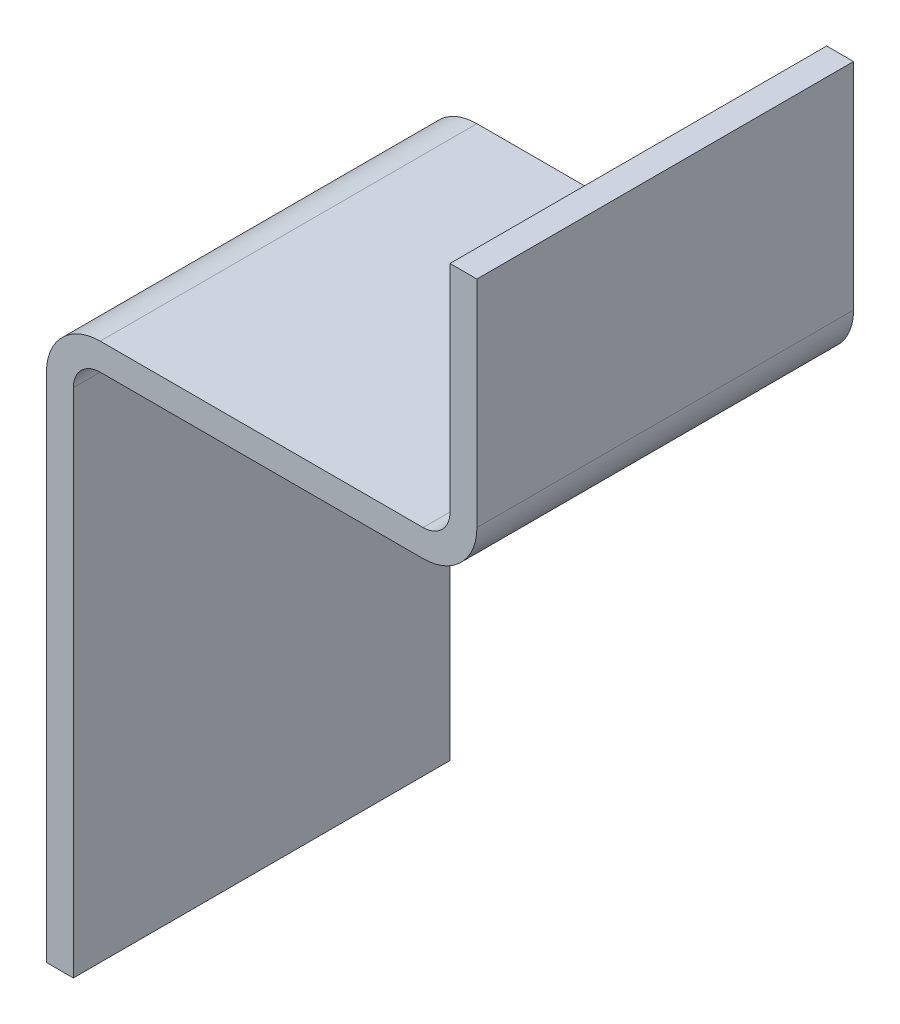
ISO-10303-21;
HEADER;
FILE_DESCRIPTION(('STEP AP214'),'2;1');
FILE_NAME('part.step','',(''),(''),'','','');
FILE_SCHEMA(('AUTOMOTIVE_DESIGN { 1 0 10303 214 1 1 1 1 }'));
ENDSEC;
DATA;
#1=APPLICATION_CONTEXT('core data for automotive mechanical design processes');
#2=APPLICATION_PROTOCOL_DEFINITION('international standard','automotive_design',2000,#1);
#3=PRODUCT_CONTEXT('',#1,'mechanical');
#4=PRODUCT('Part','Part','',(#3));
#5=PRODUCT_RELATED_PRODUCT_CATEGORY('part','',(#4));
#6=PRODUCT_DEFINITION_FORMATION('','',#4);
#7=PRODUCT_DEFINITION_CONTEXT('part definition',#1,'design');
#8=PRODUCT_DEFINITION('design','',#6,#7);
#9=PRODUCT_DEFINITION_SHAPE('','',#8);
#10=(LENGTH_UNIT() NAMED_UNIT(*) SI_UNIT(.MILLI.,.METRE.));
#11=(NAMED_UNIT(*) PLANE_ANGLE_UNIT() SI_UNIT($,.RADIAN.));
#12=(NAMED_UNIT(*) SI_UNIT($,.STERADIAN.) SOLID_ANGLE_UNIT());
#13=UNCERTAINTY_MEASURE_WITH_UNIT(LENGTH_MEASURE(1.E-05),#10,'distance_accuracy_value','');
#14=(GEOMETRIC_REPRESENTATION_CONTEXT(3) GLOBAL_UNCERTAINTY_ASSIGNED_CONTEXT((#13)) GLOBAL_UNIT_ASSIGNED_CONTEXT((#10,
#11,#12)) REPRESENTATION_CONTEXT('',''));
#15=CARTESIAN_POINT('',(0.,0.,0.));
#16=DIRECTION('',(0.,0.,1.));
#17=DIRECTION('',(1.,0.,0.));
#18=AXIS2_PLACEMENT_3D('',#15,#16,#17);
#19=CARTESIAN_POINT('',(-5.,0.,70.));
#20=DIRECTION('',(0.,1.,0.));
#21=DIRECTION('',(0.,0.,1.));
#22=AXIS2_PLACEMENT_3D('',#19,#20,#21);
#23=PLANE('',#22);
#24=DIRECTION('',(1.,0.,0.));
#25=VECTOR('',#24,1.);
#26=CARTESIAN_POINT('',(-5.,0.,0.));
#27=LINE('',#26,#25);
#28=CARTESIAN_POINT('',(-5.,0.,0.));
#29=VERTEX_POINT('',#28);
#30=CARTESIAN_POINT('',(0.,0.,0.));
#31=VERTEX_POINT('',#30);
#32=EDGE_CURVE('E124',#29,#31,#27,.T.);
#33=ORIENTED_EDGE('',*,*,#32,.T.);
#34=DIRECTION('',(0.,0.,-1.));
#35=VECTOR('',#34,1.);
#36=CARTESIAN_POINT('',(0.,0.,70.));
#37=LINE('',#36,#35);
#38=CARTESIAN_POINT('',(0.,0.,70.));
#39=VERTEX_POINT('',#38);
#40=EDGE_CURVE('E11',#39,#31,#37,.T.);
#41=ORIENTED_EDGE('',*,*,#40,.F.);
#42=DIRECTION('',(1.,0.,0.));
#43=VECTOR('',#42,1.);
#44=CARTESIAN_POINT('',(-5.,0.,70.));
#45=LINE('',#44,#43);
#46=CARTESIAN_POINT('',(-5.,0.,70.));
#47=VERTEX_POINT('',#46);
#48=EDGE_CURVE('E165',#47,#39,#45,.T.);
#49=ORIENTED_EDGE('',*,*,#48,.F.);
#50=DIRECTION('',(0.,0.,-1.));
#51=VECTOR('',#50,1.);
#52=CARTESIAN_POINT('',(-5.,0.,70.));
#53=LINE('',#52,#51);
#54=EDGE_CURVE('E43',#47,#29,#53,.T.);
#55=ORIENTED_EDGE('',*,*,#54,.T.);
#56=EDGE_LOOP('',(#33,#41,#49,#55));
#57=FACE_BOUND('',#56,.T.);
#58=ADVANCED_FACE('F29',(#57),#23,.F.);
#59=CARTESIAN_POINT('',(0.,0.,70.));
#60=DIRECTION('',(-1.,0.,0.));
#61=DIRECTION('',(0.,0.,1.));
#62=AXIS2_PLACEMENT_3D('',#59,#60,#61);
#63=PLANE('',#62);
#64=DIRECTION('',(0.,1.,0.));
#65=VECTOR('',#64,1.);
#66=CARTESIAN_POINT('',(0.,0.,0.));
#67=LINE('',#66,#65);
#68=CARTESIAN_POINT('',(0.,95.,0.));
#69=VERTEX_POINT('',#68);
#70=EDGE_CURVE('E120',#31,#69,#67,.T.);
#71=ORIENTED_EDGE('',*,*,#70,.T.);
#72=DIRECTION('',(0.,0.,-1.));
#73=VECTOR('',#72,1.);
#74=CARTESIAN_POINT('',(0.,95.,70.));
#75=LINE('',#74,#73);
#76=CARTESIAN_POINT('',(0.,95.,70.));
#77=VERTEX_POINT('',#76);
#78=EDGE_CURVE('E36',#77,#69,#75,.T.);
#79=ORIENTED_EDGE('',*,*,#78,.F.);
#80=DIRECTION('',(0.,1.,0.));
#81=VECTOR('',#80,1.);
#82=CARTESIAN_POINT('',(0.,0.,70.));
#83=LINE('',#82,#81);
#84=EDGE_CURVE('E133',#39,#77,#83,.T.);
#85=ORIENTED_EDGE('',*,*,#84,.F.);
#86=ORIENTED_EDGE('',*,*,#40,.T.);
#87=EDGE_LOOP('',(#71,#79,#85,#86));
#88=FACE_BOUND('',#87,.T.);
#89=ADVANCED_FACE('F132',(#88),#63,.F.);
#90=CARTESIAN_POINT('',(5.,95.,70.));
#91=DIRECTION('',(0.,0.,-1.));
#92=DIRECTION('',(-1.,0.,0.));
#93=AXIS2_PLACEMENT_3D('',#90,#91,#92);
#94=CYLINDRICAL_SURFACE('',#93,5.);
#95=CARTESIAN_POINT('',(5.,95.,0.));
#96=DIRECTION('',(0.,0.,-1.));
#97=DIRECTION('',(-1.,0.,0.));
#98=AXIS2_PLACEMENT_3D('',#95,#96,#97);
#99=CIRCLE('',#98,5.);
#100=CARTESIAN_POINT('',(5.,100.,0.));
#101=VERTEX_POINT('',#100);
#102=EDGE_CURVE('E126',#69,#101,#99,.T.);
#103=ORIENTED_EDGE('',*,*,#102,.T.);
#104=DIRECTION('',(0.,0.,-1.));
#105=VECTOR('',#104,1.);
#106=CARTESIAN_POINT('',(5.,100.,70.));
#107=LINE('',#106,#105);
#108=CARTESIAN_POINT('',(5.,100.,70.));
#109=VERTEX_POINT('',#108);
#110=EDGE_CURVE('E208',#109,#101,#107,.T.);
#111=ORIENTED_EDGE('',*,*,#110,.F.);
#112=CARTESIAN_POINT('',(5.,95.,70.));
#113=DIRECTION('',(0.,0.,-1.));
#114=DIRECTION('',(-1.,0.,0.));
#115=AXIS2_PLACEMENT_3D('',#112,#113,#114);
#116=CIRCLE('',#115,5.);
#117=EDGE_CURVE('E168',#77,#109,#116,.T.);
#118=ORIENTED_EDGE('',*,*,#117,.F.);
#119=ORIENTED_EDGE('',*,*,#78,.T.);
#120=EDGE_LOOP('',(#103,#111,#118,#119));
#121=FACE_BOUND('',#120,.T.);
#122=ADVANCED_FACE('F212',(#121),#94,.F.);
#123=CARTESIAN_POINT('',(5.,100.,70.));
#124=DIRECTION('',(0.,1.,0.));
#125=DIRECTION('',(0.,0.,1.));
#126=AXIS2_PLACEMENT_3D('',#123,#124,#125);
#127=PLANE('',#126);
#128=DIRECTION('',(1.,0.,0.));
#129=VECTOR('',#128,1.);
#130=CARTESIAN_POINT('',(5.,100.,0.));
#131=LINE('',#130,#129);
#132=CARTESIAN_POINT('',(65.,100.,0.));
#133=VERTEX_POINT('',#132);
#134=EDGE_CURVE('E139',#101,#133,#131,.T.);
#135=ORIENTED_EDGE('',*,*,#134,.T.);
#136=DIRECTION('',(0.,0.,-1.));
#137=VECTOR('',#136,1.);
#138=CARTESIAN_POINT('',(65.,100.,70.));
#139=LINE('',#138,#137);
#140=CARTESIAN_POINT('',(65.,100.,70.));
#141=VERTEX_POINT('',#140);
#142=EDGE_CURVE('E206',#141,#133,#139,.T.);
#143=ORIENTED_EDGE('',*,*,#142,.F.);
#144=DIRECTION('',(1.,0.,0.));
#145=VECTOR('',#144,1.);
#146=CARTESIAN_POINT('',(5.,100.,70.));
#147=LINE('',#146,#145);
#148=EDGE_CURVE('E170',#109,#141,#147,.T.);
#149=ORIENTED_EDGE('',*,*,#148,.F.);
#150=ORIENTED_EDGE('',*,*,#110,.T.);
#151=EDGE_LOOP('',(#135,#143,#149,#150));
#152=FACE_BOUND('',#151,.T.);
#153=ADVANCED_FACE('F246',(#152),#127,.F.);
#154=CARTESIAN_POINT('',(65.,110.,70.));
#155=DIRECTION('',(0.,0.,-1.));
#156=DIRECTION('',(-1.,0.,0.));
#157=AXIS2_PLACEMENT_3D('',#154,#155,#156);
#158=CYLINDRICAL_SURFACE('',#157,9.99999999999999);
#159=CARTESIAN_POINT('',(65.,110.,0.));
#160=DIRECTION('',(0.,0.,-1.));
#161=DIRECTION('',(-1.,0.,0.));
#162=AXIS2_PLACEMENT_3D('',#159,#160,#161);
#163=CIRCLE('',#162,9.99999999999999);
#164=CARTESIAN_POINT('',(75.,110.,0.));
#165=VERTEX_POINT('',#164);
#166=EDGE_CURVE('E142',#165,#133,#163,.T.);
#167=ORIENTED_EDGE('',*,*,#166,.F.);
#168=DIRECTION('',(0.,0.,-1.));
#169=VECTOR('',#168,1.);
#170=CARTESIAN_POINT('',(75.,110.,70.));
#171=LINE('',#170,#169);
#172=CARTESIAN_POINT('',(75.,110.,70.));
#173=VERTEX_POINT('',#172);
#174=EDGE_CURVE('E204',#173,#165,#171,.T.);
#175=ORIENTED_EDGE('',*,*,#174,.F.);
#176=CARTESIAN_POINT('',(65.,110.,70.));
#177=DIRECTION('',(0.,0.,-1.));
#178=DIRECTION('',(-1.,0.,0.));
#179=AXIS2_PLACEMENT_3D('',#176,#177,#178);
#180=CIRCLE('',#179,9.99999999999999);
#181=EDGE_CURVE('E172',#173,#141,#180,.T.);
#182=ORIENTED_EDGE('',*,*,#181,.T.);
#183=ORIENTED_EDGE('',*,*,#142,.T.);
#184=EDGE_LOOP('',(#167,#175,#182,#183));
#185=FACE_BOUND('',#184,.T.);
#186=ADVANCED_FACE('F243',(#185),#158,.T.);
#187=CARTESIAN_POINT('',(75.,110.,70.));
#188=DIRECTION('',(-1.,0.,0.));
#189=DIRECTION('',(0.,0.,1.));
#190=AXIS2_PLACEMENT_3D('',#187,#188,#189);
#191=PLANE('',#190);
#192=DIRECTION('',(0.,1.,0.));
#193=VECTOR('',#192,1.);
#194=CARTESIAN_POINT('',(75.,110.,0.));
#195=LINE('',#194,#193);
#196=CARTESIAN_POINT('',(75.,150.,0.));
#197=VERTEX_POINT('',#196);
#198=EDGE_CURVE('E145',#165,#197,#195,.T.);
#199=ORIENTED_EDGE('',*,*,#198,.T.);
#200=DIRECTION('',(0.,0.,-1.));
#201=VECTOR('',#200,1.);
#202=CARTESIAN_POINT('',(75.,150.,70.));
#203=LINE('',#202,#201);
#204=CARTESIAN_POINT('',(75.,150.,70.));
#205=VERTEX_POINT('',#204);
#206=EDGE_CURVE('E202',#205,#197,#203,.T.);
#207=ORIENTED_EDGE('',*,*,#206,.F.);
#208=DIRECTION('',(0.,1.,0.));
#209=VECTOR('',#208,1.);
#210=CARTESIAN_POINT('',(75.,110.,70.));
#211=LINE('',#210,#209);
#212=EDGE_CURVE('E175',#173,#205,#211,.T.);
#213=ORIENTED_EDGE('',*,*,#212,.F.);
#214=ORIENTED_EDGE('',*,*,#174,.T.);
#215=EDGE_LOOP('',(#199,#207,#213,#214));
#216=FACE_BOUND('',#215,.T.);
#217=ADVANCED_FACE('F253',(#216),#191,.F.);
#218=CARTESIAN_POINT('',(70.,150.,70.));
#219=DIRECTION('',(0.,1.,0.));
#220=DIRECTION('',(0.,0.,1.));
#221=AXIS2_PLACEMENT_3D('',#218,#219,#220);
#222=PLANE('',#221);
#223=DIRECTION('',(1.,0.,0.));
#224=VECTOR('',#223,1.);
#225=CARTESIAN_POINT('',(70.,150.,0.));
#226=LINE('',#225,#224);
#227=CARTESIAN_POINT('',(70.,150.,0.));
#228=VERTEX_POINT('',#227);
#229=EDGE_CURVE('E148',#228,#197,#226,.T.);
#230=ORIENTED_EDGE('',*,*,#229,.F.);
#231=DIRECTION('',(0.,0.,-1.));
#232=VECTOR('',#231,1.);
#233=CARTESIAN_POINT('',(70.,150.,70.));
#234=LINE('',#233,#232);
#235=CARTESIAN_POINT('',(70.,150.,70.));
#236=VERTEX_POINT('',#235);
#237=EDGE_CURVE('E200',#236,#228,#234,.T.);
#238=ORIENTED_EDGE('',*,*,#237,.F.);
#239=DIRECTION('',(1.,0.,0.));
#240=VECTOR('',#239,1.);
#241=CARTESIAN_POINT('',(70.,150.,70.));
#242=LINE('',#241,#240);
#243=EDGE_CURVE('E177',#236,#205,#242,.T.);
#244=ORIENTED_EDGE('',*,*,#243,.T.);
#245=ORIENTED_EDGE('',*,*,#206,.T.);
#246=EDGE_LOOP('',(#230,#238,#244,#245));
#247=FACE_BOUND('',#246,.T.);
#248=ADVANCED_FACE('F237',(#247),#222,.T.);
#249=CARTESIAN_POINT('',(70.,110.,70.));
#250=DIRECTION('',(-1.,0.,0.));
#251=DIRECTION('',(0.,0.,1.));
#252=AXIS2_PLACEMENT_3D('',#249,#250,#251);
#253=PLANE('',#252);
#254=DIRECTION('',(0.,1.,0.));
#255=VECTOR('',#254,1.);
#256=CARTESIAN_POINT('',(70.,110.,0.));
#257=LINE('',#256,#255);
#258=CARTESIAN_POINT('',(70.,110.,0.));
#259=VERTEX_POINT('',#258);
#260=EDGE_CURVE('E151',#259,#228,#257,.T.);
#261=ORIENTED_EDGE('',*,*,#260,.F.);
#262=DIRECTION('',(0.,0.,-1.));
#263=VECTOR('',#262,1.);
#264=CARTESIAN_POINT('',(70.,110.,70.));
#265=LINE('',#264,#263);
#266=CARTESIAN_POINT('',(70.,110.,70.));
#267=VERTEX_POINT('',#266);
#268=EDGE_CURVE('E198',#267,#259,#265,.T.);
#269=ORIENTED_EDGE('',*,*,#268,.F.);
#270=DIRECTION('',(0.,1.,0.));
#271=VECTOR('',#270,1.);
#272=CARTESIAN_POINT('',(70.,110.,70.));
#273=LINE('',#272,#271);
#274=EDGE_CURVE('E180',#267,#236,#273,.T.);
#275=ORIENTED_EDGE('',*,*,#274,.T.);
#276=ORIENTED_EDGE('',*,*,#237,.T.);
#277=EDGE_LOOP('',(#261,#269,#275,#276));
#278=FACE_BOUND('',#277,.T.);
#279=ADVANCED_FACE('F232',(#278),#253,.T.);
#280=CARTESIAN_POINT('',(65.,110.,70.));
#281=DIRECTION('',(0.,0.,-1.));
#282=DIRECTION('',(-1.,0.,0.));
#283=AXIS2_PLACEMENT_3D('',#280,#281,#282);
#284=CYLINDRICAL_SURFACE('',#283,5.);
#285=CARTESIAN_POINT('',(65.,110.,0.));
#286=DIRECTION('',(0.,0.,-1.));
#287=DIRECTION('',(-1.,0.,0.));
#288=AXIS2_PLACEMENT_3D('',#285,#286,#287);
#289=CIRCLE('',#288,5.);
#290=CARTESIAN_POINT('',(65.,105.,0.));
#291=VERTEX_POINT('',#290);
#292=EDGE_CURVE('E154',#259,#291,#289,.T.);
#293=ORIENTED_EDGE('',*,*,#292,.T.);
#294=DIRECTION('',(0.,0.,-1.));
#295=VECTOR('',#294,1.);
#296=CARTESIAN_POINT('',(65.,105.,70.));
#297=LINE('',#296,#295);
#298=CARTESIAN_POINT('',(65.,105.,70.));
#299=VERTEX_POINT('',#298);
#300=EDGE_CURVE('E196',#299,#291,#297,.T.);
#301=ORIENTED_EDGE('',*,*,#300,.F.);
#302=CARTESIAN_POINT('',(65.,110.,70.));
#303=DIRECTION('',(0.,0.,-1.));
#304=DIRECTION('',(-1.,0.,0.));
#305=AXIS2_PLACEMENT_3D('',#302,#303,#304);
#306=CIRCLE('',#305,5.);
#307=EDGE_CURVE('E183',#267,#299,#306,.T.);
#308=ORIENTED_EDGE('',*,*,#307,.F.);
#309=ORIENTED_EDGE('',*,*,#268,.T.);
#310=EDGE_LOOP('',(#293,#301,#308,#309));
#311=FACE_BOUND('',#310,.T.);
#312=ADVANCED_FACE('F229',(#311),#284,.F.);
#313=CARTESIAN_POINT('',(5.,105.,70.));
#314=DIRECTION('',(0.,1.,0.));
#315=DIRECTION('',(0.,0.,1.));
#316=AXIS2_PLACEMENT_3D('',#313,#314,#315);
#317=PLANE('',#316);
#318=DIRECTION('',(1.,0.,0.));
#319=VECTOR('',#318,1.);
#320=CARTESIAN_POINT('',(5.,105.,0.));
#321=LINE('',#320,#319);
#322=CARTESIAN_POINT('',(5.,105.,0.));
#323=VERTEX_POINT('',#322);
#324=EDGE_CURVE('E157',#323,#291,#321,.T.);
#325=ORIENTED_EDGE('',*,*,#324,.F.);
#326=DIRECTION('',(0.,0.,-1.));
#327=VECTOR('',#326,1.);
#328=CARTESIAN_POINT('',(5.,105.,70.));
#329=LINE('',#328,#327);
#330=CARTESIAN_POINT('',(5.,105.,70.));
#331=VERTEX_POINT('',#330);
#332=EDGE_CURVE('E194',#331,#323,#329,.T.);
#333=ORIENTED_EDGE('',*,*,#332,.F.);
#334=DIRECTION('',(1.,0.,0.));
#335=VECTOR('',#334,1.);
#336=CARTESIAN_POINT('',(5.,105.,70.));
#337=LINE('',#336,#335);
#338=EDGE_CURVE('E185',#331,#299,#337,.T.);
#339=ORIENTED_EDGE('',*,*,#338,.T.);
#340=ORIENTED_EDGE('',*,*,#300,.T.);
#341=EDGE_LOOP('',(#325,#333,#339,#340));
#342=FACE_BOUND('',#341,.T.);
#343=ADVANCED_FACE('F225',(#342),#317,.T.);
#344=CARTESIAN_POINT('',(5.,95.,70.));
#345=DIRECTION('',(0.,0.,-1.));
#346=DIRECTION('',(-1.,0.,0.));
#347=AXIS2_PLACEMENT_3D('',#344,#345,#346);
#348=CYLINDRICAL_SURFACE('',#347,10.);
#349=CARTESIAN_POINT('',(5.,95.,0.));
#350=DIRECTION('',(0.,0.,1.));
#351=DIRECTION('',(1.,0.,0.));
#352=AXIS2_PLACEMENT_3D('',#349,#350,#351);
#353=CIRCLE('',#352,10.);
#354=CARTESIAN_POINT('',(-5.,95.,0.));
#355=VERTEX_POINT('',#354);
#356=EDGE_CURVE('E160',#323,#355,#353,.T.);
#357=ORIENTED_EDGE('',*,*,#356,.T.);
#358=DIRECTION('',(0.,0.,-1.));
#359=VECTOR('',#358,1.);
#360=CARTESIAN_POINT('',(-5.,95.,70.));
#361=LINE('',#360,#359);
#362=CARTESIAN_POINT('',(-5.,95.,70.));
#363=VERTEX_POINT('',#362);
#364=EDGE_CURVE('E192',#363,#355,#361,.T.);
#365=ORIENTED_EDGE('',*,*,#364,.F.);
#366=CARTESIAN_POINT('',(5.,95.,70.));
#367=DIRECTION('',(0.,0.,1.));
#368=DIRECTION('',(1.,0.,0.));
#369=AXIS2_PLACEMENT_3D('',#366,#367,#368);
#370=CIRCLE('',#369,10.);
#371=EDGE_CURVE('E51',#331,#363,#370,.T.);
#372=ORIENTED_EDGE('',*,*,#371,.F.);
#373=ORIENTED_EDGE('',*,*,#332,.T.);
#374=EDGE_LOOP('',(#357,#365,#372,#373));
#375=FACE_BOUND('',#374,.T.);
#376=ADVANCED_FACE('F221',(#375),#348,.T.);
#377=CARTESIAN_POINT('',(-5.,0.,70.));
#378=DIRECTION('',(-1.,0.,0.));
#379=DIRECTION('',(0.,0.,1.));
#380=AXIS2_PLACEMENT_3D('',#377,#378,#379);
#381=PLANE('',#380);
#382=DIRECTION('',(0.,1.,0.));
#383=VECTOR('',#382,1.);
#384=CARTESIAN_POINT('',(-5.,0.,0.));
#385=LINE('',#384,#383);
#386=EDGE_CURVE('E163',#29,#355,#385,.T.);
#387=ORIENTED_EDGE('',*,*,#386,.F.);
#388=ORIENTED_EDGE('',*,*,#54,.F.);
#389=DIRECTION('',(0.,1.,0.));
#390=VECTOR('',#389,1.);
#391=CARTESIAN_POINT('',(-5.,0.,70.));
#392=LINE('',#391,#390);
#393=EDGE_CURVE('E189',#47,#363,#392,.T.);
#394=ORIENTED_EDGE('',*,*,#393,.T.);
#395=ORIENTED_EDGE('',*,*,#364,.T.);
#396=EDGE_LOOP('',(#387,#388,#394,#395));
#397=FACE_BOUND('',#396,.T.);
#398=ADVANCED_FACE('F218',(#397),#381,.T.);
#399=CARTESIAN_POINT('',(5.,95.,70.));
#400=DIRECTION('',(0.,0.,-1.));
#401=DIRECTION('',(-1.,0.,0.));
#402=AXIS2_PLACEMENT_3D('',#399,#400,#401);
#403=PLANE('',#402);
#404=ORIENTED_EDGE('',*,*,#48,.T.);
#405=ORIENTED_EDGE('',*,*,#84,.T.);
#406=ORIENTED_EDGE('',*,*,#117,.T.);
#407=ORIENTED_EDGE('',*,*,#148,.T.);
#408=ORIENTED_EDGE('',*,*,#181,.F.);
#409=ORIENTED_EDGE('',*,*,#212,.T.);
#410=ORIENTED_EDGE('',*,*,#243,.F.);
#411=ORIENTED_EDGE('',*,*,#274,.F.);
#412=ORIENTED_EDGE('',*,*,#307,.T.);
#413=ORIENTED_EDGE('',*,*,#338,.F.);
#414=ORIENTED_EDGE('',*,*,#371,.T.);
#415=ORIENTED_EDGE('',*,*,#393,.F.);
#416=EDGE_LOOP('',(#404,#405,#406,#407,#408,#409,#410,#411,#412,#413,#414,#415));
#417=FACE_BOUND('',#416,.T.);
#418=ADVANCED_FACE('F215',(#417),#403,.F.);
#419=CARTESIAN_POINT('',(5.,95.,0.));
#420=DIRECTION('',(0.,0.,-1.));
#421=DIRECTION('',(-1.,0.,0.));
#422=AXIS2_PLACEMENT_3D('',#419,#420,#421);
#423=PLANE('',#422);
#424=ORIENTED_EDGE('',*,*,#32,.F.);
#425=ORIENTED_EDGE('',*,*,#386,.T.);
#426=ORIENTED_EDGE('',*,*,#356,.F.);
#427=ORIENTED_EDGE('',*,*,#324,.T.);
#428=ORIENTED_EDGE('',*,*,#292,.F.);
#429=ORIENTED_EDGE('',*,*,#260,.T.);
#430=ORIENTED_EDGE('',*,*,#229,.T.);
#431=ORIENTED_EDGE('',*,*,#198,.F.);
#432=ORIENTED_EDGE('',*,*,#166,.T.);
#433=ORIENTED_EDGE('',*,*,#134,.F.);
#434=ORIENTED_EDGE('',*,*,#102,.F.);
#435=ORIENTED_EDGE('',*,*,#70,.F.);
#436=EDGE_LOOP('',(#424,#425,#426,#427,#428,#429,#430,#431,#432,#433,#434,#435));
#437=FACE_BOUND('',#436,.T.);
#438=ADVANCED_FACE('F121',(#437),#423,.T.);
#439=CLOSED_SHELL('',(#58,#89,#122,#153,#186,#217,#248,#279,#312,#343,#376,#398,#418,#438));
#440=MANIFOLD_SOLID_BREP('B2',#439);
#441=ADVANCED_BREP_SHAPE_REPRESENTATION('',(#18,#440),#14);
#442=SHAPE_DEFINITION_REPRESENTATION(#9,#441);
ENDSEC;
END-ISO-10303-21;
